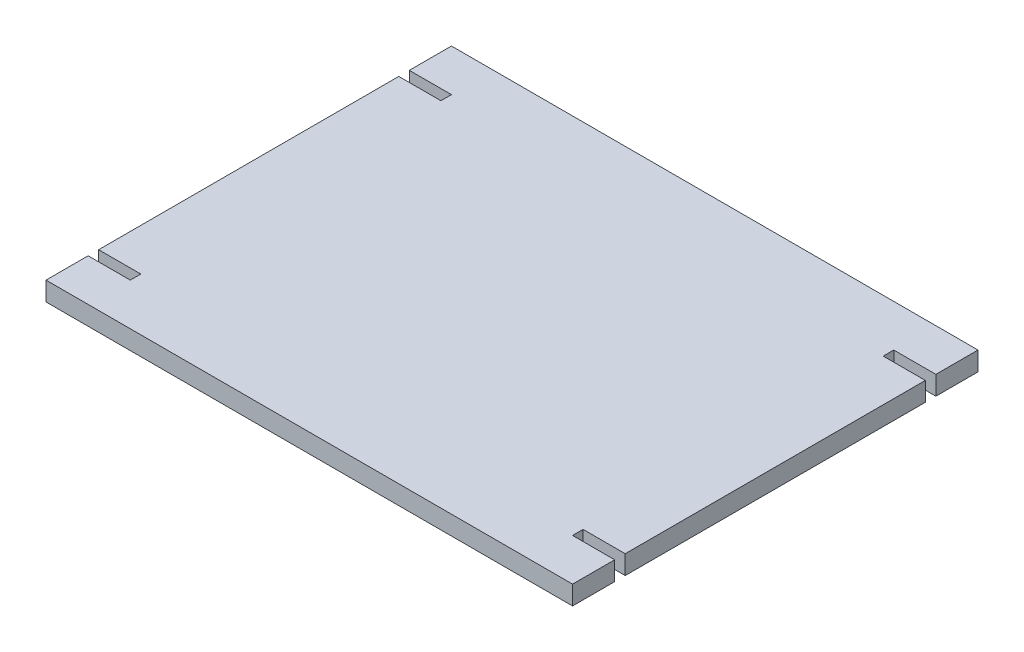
ISO-10303-21;
HEADER;
FILE_DESCRIPTION(('STEP AP214'),'2;1');
FILE_NAME('part.step','',(''),(''),'','','');
FILE_SCHEMA(('AUTOMOTIVE_DESIGN { 1 0 10303 214 1 1 1 1 }'));
ENDSEC;
DATA;
#1=APPLICATION_CONTEXT('core data for automotive mechanical design processes');
#2=APPLICATION_PROTOCOL_DEFINITION('international standard','automotive_design',2000,#1);
#3=PRODUCT_CONTEXT('',#1,'mechanical');
#4=PRODUCT('Part','Part','',(#3));
#5=PRODUCT_RELATED_PRODUCT_CATEGORY('part','',(#4));
#6=PRODUCT_DEFINITION_FORMATION('','',#4);
#7=PRODUCT_DEFINITION_CONTEXT('part definition',#1,'design');
#8=PRODUCT_DEFINITION('design','',#6,#7);
#9=PRODUCT_DEFINITION_SHAPE('','',#8);
#10=(LENGTH_UNIT() NAMED_UNIT(*) SI_UNIT(.MILLI.,.METRE.));
#11=(NAMED_UNIT(*) PLANE_ANGLE_UNIT() SI_UNIT($,.RADIAN.));
#12=(NAMED_UNIT(*) SI_UNIT($,.STERADIAN.) SOLID_ANGLE_UNIT());
#13=UNCERTAINTY_MEASURE_WITH_UNIT(LENGTH_MEASURE(1.E-05),#10,'distance_accuracy_value','');
#14=(GEOMETRIC_REPRESENTATION_CONTEXT(3) GLOBAL_UNCERTAINTY_ASSIGNED_CONTEXT((#13)) GLOBAL_UNIT_ASSIGNED_CONTEXT((#10,
#11,#12)) REPRESENTATION_CONTEXT('',''));
#15=CARTESIAN_POINT('',(0.,0.,0.));
#16=DIRECTION('',(0.,0.,1.));
#17=DIRECTION('',(1.,0.,0.));
#18=AXIS2_PLACEMENT_3D('',#15,#16,#17);
#19=CARTESIAN_POINT('',(-301.875,18.,-164.0625));
#20=DIRECTION('',(1.,0.,0.));
#21=DIRECTION('',(0.,0.,-1.));
#22=AXIS2_PLACEMENT_3D('',#19,#20,#21);
#23=PLANE('',#22);
#24=DIRECTION('',(0.,0.,1.));
#25=VECTOR('',#24,1.);
#26=CARTESIAN_POINT('',(-301.875,0.,-164.0625));
#27=LINE('',#26,#25);
#28=CARTESIAN_POINT('',(-301.875,0.,-204.0625));
#29=VERTEX_POINT('',#28);
#30=CARTESIAN_POINT('',(-301.875,0.,-164.0625));
#31=VERTEX_POINT('',#30);
#32=EDGE_CURVE('E201',#29,#31,#27,.T.);
#33=ORIENTED_EDGE('',*,*,#32,.T.);
#34=DIRECTION('',(0.,-1.,0.));
#35=VECTOR('',#34,1.);
#36=CARTESIAN_POINT('',(-301.875,18.,-164.0625));
#37=LINE('',#36,#35);
#38=CARTESIAN_POINT('',(-301.875,18.,-164.0625));
#39=VERTEX_POINT('',#38);
#40=EDGE_CURVE('E11',#39,#31,#37,.T.);
#41=ORIENTED_EDGE('',*,*,#40,.F.);
#42=DIRECTION('',(0.,0.,1.));
#43=VECTOR('',#42,1.);
#44=CARTESIAN_POINT('',(-301.875,18.,-164.0625));
#45=LINE('',#44,#43);
#46=CARTESIAN_POINT('',(-301.875,18.,-204.0625));
#47=VERTEX_POINT('',#46);
#48=EDGE_CURVE('E239',#47,#39,#45,.T.);
#49=ORIENTED_EDGE('',*,*,#48,.F.);
#50=DIRECTION('',(0.,-1.,0.));
#51=VECTOR('',#50,1.);
#52=CARTESIAN_POINT('',(-301.875,18.,-204.0625));
#53=LINE('',#52,#51);
#54=EDGE_CURVE('E197',#47,#29,#53,.T.);
#55=ORIENTED_EDGE('',*,*,#54,.T.);
#56=EDGE_LOOP('',(#33,#41,#49,#55));
#57=FACE_BOUND('',#56,.T.);
#58=ADVANCED_FACE('F33',(#57),#23,.F.);
#59=CARTESIAN_POINT('',(-261.875,18.,-164.0625));
#60=DIRECTION('',(0.,0.,-1.));
#61=DIRECTION('',(-1.,0.,0.));
#62=AXIS2_PLACEMENT_3D('',#59,#60,#61);
#63=PLANE('',#62);
#64=DIRECTION('',(1.,0.,0.));
#65=VECTOR('',#64,1.);
#66=CARTESIAN_POINT('',(-261.875,0.,-164.0625));
#67=LINE('',#66,#65);
#68=CARTESIAN_POINT('',(-261.875,0.,-164.0625));
#69=VERTEX_POINT('',#68);
#70=EDGE_CURVE('E204',#31,#69,#67,.T.);
#71=ORIENTED_EDGE('',*,*,#70,.T.);
#72=DIRECTION('',(0.,-1.,0.));
#73=VECTOR('',#72,1.);
#74=CARTESIAN_POINT('',(-261.875,18.,-164.0625));
#75=LINE('',#74,#73);
#76=CARTESIAN_POINT('',(-261.875,18.,-164.0625));
#77=VERTEX_POINT('',#76);
#78=EDGE_CURVE('E41',#77,#69,#75,.T.);
#79=ORIENTED_EDGE('',*,*,#78,.F.);
#80=DIRECTION('',(1.,0.,0.));
#81=VECTOR('',#80,1.);
#82=CARTESIAN_POINT('',(-261.875,18.,-164.0625));
#83=LINE('',#82,#81);
#84=EDGE_CURVE('E128',#39,#77,#83,.T.);
#85=ORIENTED_EDGE('',*,*,#84,.F.);
#86=ORIENTED_EDGE('',*,*,#40,.T.);
#87=EDGE_LOOP('',(#71,#79,#85,#86));
#88=FACE_BOUND('',#87,.T.);
#89=ADVANCED_FACE('F357',(#88),#63,.F.);
#90=CARTESIAN_POINT('',(-261.875,18.,-154.0625));
#91=DIRECTION('',(1.,0.,0.));
#92=DIRECTION('',(0.,0.,-1.));
#93=AXIS2_PLACEMENT_3D('',#90,#91,#92);
#94=PLANE('',#93);
#95=DIRECTION('',(0.,0.,1.));
#96=VECTOR('',#95,1.);
#97=CARTESIAN_POINT('',(-261.875,0.,-154.0625));
#98=LINE('',#97,#96);
#99=CARTESIAN_POINT('',(-261.875,0.,-154.0625));
#100=VERTEX_POINT('',#99);
#101=EDGE_CURVE('E206',#69,#100,#98,.T.);
#102=ORIENTED_EDGE('',*,*,#101,.T.);
#103=DIRECTION('',(0.,-1.,0.));
#104=VECTOR('',#103,1.);
#105=CARTESIAN_POINT('',(-261.875,18.,-154.0625));
#106=LINE('',#105,#104);
#107=CARTESIAN_POINT('',(-261.875,18.,-154.0625));
#108=VERTEX_POINT('',#107);
#109=EDGE_CURVE('E282',#108,#100,#106,.T.);
#110=ORIENTED_EDGE('',*,*,#109,.F.);
#111=DIRECTION('',(0.,0.,1.));
#112=VECTOR('',#111,1.);
#113=CARTESIAN_POINT('',(-261.875,18.,-154.0625));
#114=LINE('',#113,#112);
#115=EDGE_CURVE('E290',#77,#108,#114,.T.);
#116=ORIENTED_EDGE('',*,*,#115,.F.);
#117=ORIENTED_EDGE('',*,*,#78,.T.);
#118=EDGE_LOOP('',(#102,#110,#116,#117));
#119=FACE_BOUND('',#118,.T.);
#120=ADVANCED_FACE('F288',(#119),#94,.F.);
#121=CARTESIAN_POINT('',(-301.875,18.,-154.0625));
#122=DIRECTION('',(0.,0.,1.));
#123=DIRECTION('',(1.,0.,0.));
#124=AXIS2_PLACEMENT_3D('',#121,#122,#123);
#125=PLANE('',#124);
#126=DIRECTION('',(-1.,0.,0.));
#127=VECTOR('',#126,1.);
#128=CARTESIAN_POINT('',(-301.875,0.,-154.0625));
#129=LINE('',#128,#127);
#130=CARTESIAN_POINT('',(-301.875,0.,-154.0625));
#131=VERTEX_POINT('',#130);
#132=EDGE_CURVE('E208',#100,#131,#129,.T.);
#133=ORIENTED_EDGE('',*,*,#132,.T.);
#134=DIRECTION('',(0.,-1.,0.));
#135=VECTOR('',#134,1.);
#136=CARTESIAN_POINT('',(-301.875,18.,-154.0625));
#137=LINE('',#136,#135);
#138=CARTESIAN_POINT('',(-301.875,18.,-154.0625));
#139=VERTEX_POINT('',#138);
#140=EDGE_CURVE('E279',#139,#131,#137,.T.);
#141=ORIENTED_EDGE('',*,*,#140,.F.);
#142=DIRECTION('',(-1.,0.,0.));
#143=VECTOR('',#142,1.);
#144=CARTESIAN_POINT('',(-301.875,18.,-154.0625));
#145=LINE('',#144,#143);
#146=EDGE_CURVE('E308',#108,#139,#145,.T.);
#147=ORIENTED_EDGE('',*,*,#146,.F.);
#148=ORIENTED_EDGE('',*,*,#109,.T.);
#149=EDGE_LOOP('',(#133,#141,#147,#148));
#150=FACE_BOUND('',#149,.T.);
#151=ADVANCED_FACE('F299',(#150),#125,.F.);
#152=CARTESIAN_POINT('',(-301.875,18.,130.9375));
#153=DIRECTION('',(1.,0.,0.));
#154=DIRECTION('',(0.,0.,-1.));
#155=AXIS2_PLACEMENT_3D('',#152,#153,#154);
#156=PLANE('',#155);
#157=DIRECTION('',(0.,0.,1.));
#158=VECTOR('',#157,1.);
#159=CARTESIAN_POINT('',(-301.875,0.,130.9375));
#160=LINE('',#159,#158);
#161=CARTESIAN_POINT('',(-301.875,0.,130.9375));
#162=VERTEX_POINT('',#161);
#163=EDGE_CURVE('E210',#131,#162,#160,.T.);
#164=ORIENTED_EDGE('',*,*,#163,.T.);
#165=DIRECTION('',(0.,-1.,0.));
#166=VECTOR('',#165,1.);
#167=CARTESIAN_POINT('',(-301.875,18.,130.9375));
#168=LINE('',#167,#166);
#169=CARTESIAN_POINT('',(-301.875,18.,130.9375));
#170=VERTEX_POINT('',#169);
#171=EDGE_CURVE('E276',#170,#162,#168,.T.);
#172=ORIENTED_EDGE('',*,*,#171,.F.);
#173=DIRECTION('',(0.,0.,1.));
#174=VECTOR('',#173,1.);
#175=CARTESIAN_POINT('',(-301.875,18.,130.9375));
#176=LINE('',#175,#174);
#177=EDGE_CURVE('E305',#139,#170,#176,.T.);
#178=ORIENTED_EDGE('',*,*,#177,.F.);
#179=ORIENTED_EDGE('',*,*,#140,.T.);
#180=EDGE_LOOP('',(#164,#172,#178,#179));
#181=FACE_BOUND('',#180,.T.);
#182=ADVANCED_FACE('F303',(#181),#156,.F.);
#183=CARTESIAN_POINT('',(-261.875,18.,130.9375));
#184=DIRECTION('',(0.,0.,-1.));
#185=DIRECTION('',(-1.,0.,0.));
#186=AXIS2_PLACEMENT_3D('',#183,#184,#185);
#187=PLANE('',#186);
#188=DIRECTION('',(1.,0.,0.));
#189=VECTOR('',#188,1.);
#190=CARTESIAN_POINT('',(-261.875,0.,130.9375));
#191=LINE('',#190,#189);
#192=CARTESIAN_POINT('',(-261.875,0.,130.9375));
#193=VERTEX_POINT('',#192);
#194=EDGE_CURVE('E212',#162,#193,#191,.T.);
#195=ORIENTED_EDGE('',*,*,#194,.T.);
#196=DIRECTION('',(0.,-1.,0.));
#197=VECTOR('',#196,1.);
#198=CARTESIAN_POINT('',(-261.875,18.,130.9375));
#199=LINE('',#198,#197);
#200=CARTESIAN_POINT('',(-261.875,18.,130.9375));
#201=VERTEX_POINT('',#200);
#202=EDGE_CURVE('E273',#201,#193,#199,.T.);
#203=ORIENTED_EDGE('',*,*,#202,.F.);
#204=DIRECTION('',(1.,0.,0.));
#205=VECTOR('',#204,1.);
#206=CARTESIAN_POINT('',(-261.875,18.,130.9375));
#207=LINE('',#206,#205);
#208=EDGE_CURVE('E307',#170,#201,#207,.T.);
#209=ORIENTED_EDGE('',*,*,#208,.F.);
#210=ORIENTED_EDGE('',*,*,#171,.T.);
#211=EDGE_LOOP('',(#195,#203,#209,#210));
#212=FACE_BOUND('',#211,.T.);
#213=ADVANCED_FACE('F370',(#212),#187,.F.);
#214=CARTESIAN_POINT('',(-261.875,18.,140.9375));
#215=DIRECTION('',(1.,0.,0.));
#216=DIRECTION('',(0.,0.,-1.));
#217=AXIS2_PLACEMENT_3D('',#214,#215,#216);
#218=PLANE('',#217);
#219=DIRECTION('',(0.,0.,1.));
#220=VECTOR('',#219,1.);
#221=CARTESIAN_POINT('',(-261.875,0.,140.9375));
#222=LINE('',#221,#220);
#223=CARTESIAN_POINT('',(-261.875,0.,140.9375));
#224=VERTEX_POINT('',#223);
#225=EDGE_CURVE('E214',#193,#224,#222,.T.);
#226=ORIENTED_EDGE('',*,*,#225,.T.);
#227=DIRECTION('',(0.,-1.,0.));
#228=VECTOR('',#227,1.);
#229=CARTESIAN_POINT('',(-261.875,18.,140.9375));
#230=LINE('',#229,#228);
#231=CARTESIAN_POINT('',(-261.875,18.,140.9375));
#232=VERTEX_POINT('',#231);
#233=EDGE_CURVE('E270',#232,#224,#230,.T.);
#234=ORIENTED_EDGE('',*,*,#233,.F.);
#235=DIRECTION('',(0.,0.,1.));
#236=VECTOR('',#235,1.);
#237=CARTESIAN_POINT('',(-261.875,18.,140.9375));
#238=LINE('',#237,#236);
#239=EDGE_CURVE('E310',#201,#232,#238,.T.);
#240=ORIENTED_EDGE('',*,*,#239,.F.);
#241=ORIENTED_EDGE('',*,*,#202,.T.);
#242=EDGE_LOOP('',(#226,#234,#240,#241));
#243=FACE_BOUND('',#242,.T.);
#244=ADVANCED_FACE('F373',(#243),#218,.F.);
#245=CARTESIAN_POINT('',(-301.875,18.,140.9375));
#246=DIRECTION('',(0.,0.,1.));
#247=DIRECTION('',(1.,0.,0.));
#248=AXIS2_PLACEMENT_3D('',#245,#246,#247);
#249=PLANE('',#248);
#250=DIRECTION('',(-1.,0.,0.));
#251=VECTOR('',#250,1.);
#252=CARTESIAN_POINT('',(-301.875,0.,140.9375));
#253=LINE('',#252,#251);
#254=CARTESIAN_POINT('',(-301.875,0.,140.9375));
#255=VERTEX_POINT('',#254);
#256=EDGE_CURVE('E216',#224,#255,#253,.T.);
#257=ORIENTED_EDGE('',*,*,#256,.T.);
#258=DIRECTION('',(0.,-1.,0.));
#259=VECTOR('',#258,1.);
#260=CARTESIAN_POINT('',(-301.875,18.,140.9375));
#261=LINE('',#260,#259);
#262=CARTESIAN_POINT('',(-301.875,18.,140.9375));
#263=VERTEX_POINT('',#262);
#264=EDGE_CURVE('E267',#263,#255,#261,.T.);
#265=ORIENTED_EDGE('',*,*,#264,.F.);
#266=DIRECTION('',(-1.,0.,0.));
#267=VECTOR('',#266,1.);
#268=CARTESIAN_POINT('',(-301.875,18.,140.9375));
#269=LINE('',#268,#267);
#270=EDGE_CURVE('E316',#232,#263,#269,.T.);
#271=ORIENTED_EDGE('',*,*,#270,.F.);
#272=ORIENTED_EDGE('',*,*,#233,.T.);
#273=EDGE_LOOP('',(#257,#265,#271,#272));
#274=FACE_BOUND('',#273,.T.);
#275=ADVANCED_FACE('F377',(#274),#249,.F.);
#276=CARTESIAN_POINT('',(-301.875,18.,180.9375));
#277=DIRECTION('',(1.,0.,0.));
#278=DIRECTION('',(0.,0.,-1.));
#279=AXIS2_PLACEMENT_3D('',#276,#277,#278);
#280=PLANE('',#279);
#281=DIRECTION('',(0.,0.,1.));
#282=VECTOR('',#281,1.);
#283=CARTESIAN_POINT('',(-301.875,0.,180.9375));
#284=LINE('',#283,#282);
#285=CARTESIAN_POINT('',(-301.875,0.,180.9375));
#286=VERTEX_POINT('',#285);
#287=EDGE_CURVE('E218',#255,#286,#284,.T.);
#288=ORIENTED_EDGE('',*,*,#287,.T.);
#289=DIRECTION('',(0.,-1.,0.));
#290=VECTOR('',#289,1.);
#291=CARTESIAN_POINT('',(-301.875,18.,180.9375));
#292=LINE('',#291,#290);
#293=CARTESIAN_POINT('',(-301.875,18.,180.9375));
#294=VERTEX_POINT('',#293);
#295=EDGE_CURVE('E264',#294,#286,#292,.T.);
#296=ORIENTED_EDGE('',*,*,#295,.F.);
#297=DIRECTION('',(0.,0.,1.));
#298=VECTOR('',#297,1.);
#299=CARTESIAN_POINT('',(-301.875,18.,180.9375));
#300=LINE('',#299,#298);
#301=EDGE_CURVE('E318',#263,#294,#300,.T.);
#302=ORIENTED_EDGE('',*,*,#301,.F.);
#303=ORIENTED_EDGE('',*,*,#264,.T.);
#304=EDGE_LOOP('',(#288,#296,#302,#303));
#305=FACE_BOUND('',#304,.T.);
#306=ADVANCED_FACE('F381',(#305),#280,.F.);
#307=CARTESIAN_POINT('',(198.125,18.,180.9375));
#308=DIRECTION('',(0.,0.,-1.));
#309=DIRECTION('',(-1.,0.,0.));
#310=AXIS2_PLACEMENT_3D('',#307,#308,#309);
#311=PLANE('',#310);
#312=DIRECTION('',(1.,0.,0.));
#313=VECTOR('',#312,1.);
#314=CARTESIAN_POINT('',(198.125,0.,180.9375));
#315=LINE('',#314,#313);
#316=CARTESIAN_POINT('',(198.125,0.,180.9375));
#317=VERTEX_POINT('',#316);
#318=EDGE_CURVE('E220',#286,#317,#315,.T.);
#319=ORIENTED_EDGE('',*,*,#318,.T.);
#320=DIRECTION('',(0.,-1.,0.));
#321=VECTOR('',#320,1.);
#322=CARTESIAN_POINT('',(198.125,18.,180.9375));
#323=LINE('',#322,#321);
#324=CARTESIAN_POINT('',(198.125,18.,180.9375));
#325=VERTEX_POINT('',#324);
#326=EDGE_CURVE('E261',#325,#317,#323,.T.);
#327=ORIENTED_EDGE('',*,*,#326,.F.);
#328=DIRECTION('',(1.,0.,0.));
#329=VECTOR('',#328,1.);
#330=CARTESIAN_POINT('',(198.125,18.,180.9375));
#331=LINE('',#330,#329);
#332=EDGE_CURVE('E320',#294,#325,#331,.T.);
#333=ORIENTED_EDGE('',*,*,#332,.F.);
#334=ORIENTED_EDGE('',*,*,#295,.T.);
#335=EDGE_LOOP('',(#319,#327,#333,#334));
#336=FACE_BOUND('',#335,.T.);
#337=ADVANCED_FACE('F385',(#336),#311,.F.);
#338=CARTESIAN_POINT('',(198.125,18.,140.9375));
#339=DIRECTION('',(-1.,0.,0.));
#340=DIRECTION('',(0.,0.,1.));
#341=AXIS2_PLACEMENT_3D('',#338,#339,#340);
#342=PLANE('',#341);
#343=DIRECTION('',(0.,0.,-1.));
#344=VECTOR('',#343,1.);
#345=CARTESIAN_POINT('',(198.125,0.,140.9375));
#346=LINE('',#345,#344);
#347=CARTESIAN_POINT('',(198.125,0.,140.9375));
#348=VERTEX_POINT('',#347);
#349=EDGE_CURVE('E222',#317,#348,#346,.T.);
#350=ORIENTED_EDGE('',*,*,#349,.T.);
#351=DIRECTION('',(0.,-1.,0.));
#352=VECTOR('',#351,1.);
#353=CARTESIAN_POINT('',(198.125,18.,140.9375));
#354=LINE('',#353,#352);
#355=CARTESIAN_POINT('',(198.125,18.,140.9375));
#356=VERTEX_POINT('',#355);
#357=EDGE_CURVE('E258',#356,#348,#354,.T.);
#358=ORIENTED_EDGE('',*,*,#357,.F.);
#359=DIRECTION('',(0.,0.,-1.));
#360=VECTOR('',#359,1.);
#361=CARTESIAN_POINT('',(198.125,18.,140.9375));
#362=LINE('',#361,#360);
#363=EDGE_CURVE('E322',#325,#356,#362,.T.);
#364=ORIENTED_EDGE('',*,*,#363,.F.);
#365=ORIENTED_EDGE('',*,*,#326,.T.);
#366=EDGE_LOOP('',(#350,#358,#364,#365));
#367=FACE_BOUND('',#366,.T.);
#368=ADVANCED_FACE('F389',(#367),#342,.F.);
#369=CARTESIAN_POINT('',(158.125,18.,140.9375));
#370=DIRECTION('',(0.,0.,1.));
#371=DIRECTION('',(1.,0.,0.));
#372=AXIS2_PLACEMENT_3D('',#369,#370,#371);
#373=PLANE('',#372);
#374=DIRECTION('',(-1.,0.,0.));
#375=VECTOR('',#374,1.);
#376=CARTESIAN_POINT('',(158.125,0.,140.9375));
#377=LINE('',#376,#375);
#378=CARTESIAN_POINT('',(158.125,0.,140.9375));
#379=VERTEX_POINT('',#378);
#380=EDGE_CURVE('E224',#348,#379,#377,.T.);
#381=ORIENTED_EDGE('',*,*,#380,.T.);
#382=DIRECTION('',(0.,-1.,0.));
#383=VECTOR('',#382,1.);
#384=CARTESIAN_POINT('',(158.125,18.,140.9375));
#385=LINE('',#384,#383);
#386=CARTESIAN_POINT('',(158.125,18.,140.9375));
#387=VERTEX_POINT('',#386);
#388=EDGE_CURVE('E255',#387,#379,#385,.T.);
#389=ORIENTED_EDGE('',*,*,#388,.F.);
#390=DIRECTION('',(-1.,0.,0.));
#391=VECTOR('',#390,1.);
#392=CARTESIAN_POINT('',(158.125,18.,140.9375));
#393=LINE('',#392,#391);
#394=EDGE_CURVE('E324',#356,#387,#393,.T.);
#395=ORIENTED_EDGE('',*,*,#394,.F.);
#396=ORIENTED_EDGE('',*,*,#357,.T.);
#397=EDGE_LOOP('',(#381,#389,#395,#396));
#398=FACE_BOUND('',#397,.T.);
#399=ADVANCED_FACE('F393',(#398),#373,.F.);
#400=CARTESIAN_POINT('',(158.125,18.,130.9375));
#401=DIRECTION('',(-1.,0.,0.));
#402=DIRECTION('',(0.,0.,1.));
#403=AXIS2_PLACEMENT_3D('',#400,#401,#402);
#404=PLANE('',#403);
#405=DIRECTION('',(0.,0.,-1.));
#406=VECTOR('',#405,1.);
#407=CARTESIAN_POINT('',(158.125,0.,130.9375));
#408=LINE('',#407,#406);
#409=CARTESIAN_POINT('',(158.125,0.,130.9375));
#410=VERTEX_POINT('',#409);
#411=EDGE_CURVE('E226',#379,#410,#408,.T.);
#412=ORIENTED_EDGE('',*,*,#411,.T.);
#413=DIRECTION('',(0.,-1.,0.));
#414=VECTOR('',#413,1.);
#415=CARTESIAN_POINT('',(158.125,18.,130.9375));
#416=LINE('',#415,#414);
#417=CARTESIAN_POINT('',(158.125,18.,130.9375));
#418=VERTEX_POINT('',#417);
#419=EDGE_CURVE('E252',#418,#410,#416,.T.);
#420=ORIENTED_EDGE('',*,*,#419,.F.);
#421=DIRECTION('',(0.,0.,-1.));
#422=VECTOR('',#421,1.);
#423=CARTESIAN_POINT('',(158.125,18.,130.9375));
#424=LINE('',#423,#422);
#425=EDGE_CURVE('E326',#387,#418,#424,.T.);
#426=ORIENTED_EDGE('',*,*,#425,.F.);
#427=ORIENTED_EDGE('',*,*,#388,.T.);
#428=EDGE_LOOP('',(#412,#420,#426,#427));
#429=FACE_BOUND('',#428,.T.);
#430=ADVANCED_FACE('F397',(#429),#404,.F.);
#431=CARTESIAN_POINT('',(198.125,18.,130.9375));
#432=DIRECTION('',(0.,0.,-1.));
#433=DIRECTION('',(-1.,0.,0.));
#434=AXIS2_PLACEMENT_3D('',#431,#432,#433);
#435=PLANE('',#434);
#436=DIRECTION('',(1.,0.,0.));
#437=VECTOR('',#436,1.);
#438=CARTESIAN_POINT('',(198.125,0.,130.9375));
#439=LINE('',#438,#437);
#440=CARTESIAN_POINT('',(198.125,0.,130.9375));
#441=VERTEX_POINT('',#440);
#442=EDGE_CURVE('E228',#410,#441,#439,.T.);
#443=ORIENTED_EDGE('',*,*,#442,.T.);
#444=DIRECTION('',(0.,-1.,0.));
#445=VECTOR('',#444,1.);
#446=CARTESIAN_POINT('',(198.125,18.,130.9375));
#447=LINE('',#446,#445);
#448=CARTESIAN_POINT('',(198.125,18.,130.9375));
#449=VERTEX_POINT('',#448);
#450=EDGE_CURVE('E249',#449,#441,#447,.T.);
#451=ORIENTED_EDGE('',*,*,#450,.F.);
#452=DIRECTION('',(1.,0.,0.));
#453=VECTOR('',#452,1.);
#454=CARTESIAN_POINT('',(198.125,18.,130.9375));
#455=LINE('',#454,#453);
#456=EDGE_CURVE('E328',#418,#449,#455,.T.);
#457=ORIENTED_EDGE('',*,*,#456,.F.);
#458=ORIENTED_EDGE('',*,*,#419,.T.);
#459=EDGE_LOOP('',(#443,#451,#457,#458));
#460=FACE_BOUND('',#459,.T.);
#461=ADVANCED_FACE('F401',(#460),#435,.F.);
#462=CARTESIAN_POINT('',(198.125,18.,-154.0625));
#463=DIRECTION('',(-1.,0.,0.));
#464=DIRECTION('',(0.,0.,1.));
#465=AXIS2_PLACEMENT_3D('',#462,#463,#464);
#466=PLANE('',#465);
#467=DIRECTION('',(0.,0.,-1.));
#468=VECTOR('',#467,1.);
#469=CARTESIAN_POINT('',(198.125,0.,-154.0625));
#470=LINE('',#469,#468);
#471=CARTESIAN_POINT('',(198.125,0.,-154.0625));
#472=VERTEX_POINT('',#471);
#473=EDGE_CURVE('E230',#441,#472,#470,.T.);
#474=ORIENTED_EDGE('',*,*,#473,.T.);
#475=DIRECTION('',(0.,-1.,0.));
#476=VECTOR('',#475,1.);
#477=CARTESIAN_POINT('',(198.125,18.,-154.0625));
#478=LINE('',#477,#476);
#479=CARTESIAN_POINT('',(198.125,18.,-154.0625));
#480=VERTEX_POINT('',#479);
#481=EDGE_CURVE('E246',#480,#472,#478,.T.);
#482=ORIENTED_EDGE('',*,*,#481,.F.);
#483=DIRECTION('',(0.,0.,-1.));
#484=VECTOR('',#483,1.);
#485=CARTESIAN_POINT('',(198.125,18.,-154.0625));
#486=LINE('',#485,#484);
#487=EDGE_CURVE('E330',#449,#480,#486,.T.);
#488=ORIENTED_EDGE('',*,*,#487,.F.);
#489=ORIENTED_EDGE('',*,*,#450,.T.);
#490=EDGE_LOOP('',(#474,#482,#488,#489));
#491=FACE_BOUND('',#490,.T.);
#492=ADVANCED_FACE('F405',(#491),#466,.F.);
#493=CARTESIAN_POINT('',(158.125,18.,-154.0625));
#494=DIRECTION('',(0.,0.,1.));
#495=DIRECTION('',(1.,0.,0.));
#496=AXIS2_PLACEMENT_3D('',#493,#494,#495);
#497=PLANE('',#496);
#498=DIRECTION('',(-1.,0.,0.));
#499=VECTOR('',#498,1.);
#500=CARTESIAN_POINT('',(158.125,0.,-154.0625));
#501=LINE('',#500,#499);
#502=CARTESIAN_POINT('',(158.125,0.,-154.0625));
#503=VERTEX_POINT('',#502);
#504=EDGE_CURVE('E232',#472,#503,#501,.T.);
#505=ORIENTED_EDGE('',*,*,#504,.T.);
#506=DIRECTION('',(0.,-1.,0.));
#507=VECTOR('',#506,1.);
#508=CARTESIAN_POINT('',(158.125,18.,-154.0625));
#509=LINE('',#508,#507);
#510=CARTESIAN_POINT('',(158.125,18.,-154.0625));
#511=VERTEX_POINT('',#510);
#512=EDGE_CURVE('E243',#511,#503,#509,.T.);
#513=ORIENTED_EDGE('',*,*,#512,.F.);
#514=DIRECTION('',(-1.,0.,0.));
#515=VECTOR('',#514,1.);
#516=CARTESIAN_POINT('',(158.125,18.,-154.0625));
#517=LINE('',#516,#515);
#518=EDGE_CURVE('E332',#480,#511,#517,.T.);
#519=ORIENTED_EDGE('',*,*,#518,.F.);
#520=ORIENTED_EDGE('',*,*,#481,.T.);
#521=EDGE_LOOP('',(#505,#513,#519,#520));
#522=FACE_BOUND('',#521,.T.);
#523=ADVANCED_FACE('F338',(#522),#497,.F.);
#524=CARTESIAN_POINT('',(158.125,18.,-164.0625));
#525=DIRECTION('',(-1.,0.,0.));
#526=DIRECTION('',(0.,0.,1.));
#527=AXIS2_PLACEMENT_3D('',#524,#525,#526);
#528=PLANE('',#527);
#529=DIRECTION('',(0.,0.,-1.));
#530=VECTOR('',#529,1.);
#531=CARTESIAN_POINT('',(158.125,0.,-164.0625));
#532=LINE('',#531,#530);
#533=CARTESIAN_POINT('',(158.125,0.,-164.0625));
#534=VERTEX_POINT('',#533);
#535=EDGE_CURVE('E234',#503,#534,#532,.T.);
#536=ORIENTED_EDGE('',*,*,#535,.T.);
#537=DIRECTION('',(0.,-1.,0.));
#538=VECTOR('',#537,1.);
#539=CARTESIAN_POINT('',(158.125,18.,-164.0625));
#540=LINE('',#539,#538);
#541=CARTESIAN_POINT('',(158.125,18.,-164.0625));
#542=VERTEX_POINT('',#541);
#543=EDGE_CURVE('E192',#542,#534,#540,.T.);
#544=ORIENTED_EDGE('',*,*,#543,.F.);
#545=DIRECTION('',(0.,0.,-1.));
#546=VECTOR('',#545,1.);
#547=CARTESIAN_POINT('',(158.125,18.,-164.0625));
#548=LINE('',#547,#546);
#549=EDGE_CURVE('E183',#511,#542,#548,.T.);
#550=ORIENTED_EDGE('',*,*,#549,.F.);
#551=ORIENTED_EDGE('',*,*,#512,.T.);
#552=EDGE_LOOP('',(#536,#544,#550,#551));
#553=FACE_BOUND('',#552,.T.);
#554=ADVANCED_FACE('F342',(#553),#528,.F.);
#555=CARTESIAN_POINT('',(198.125,18.,-164.0625));
#556=DIRECTION('',(0.,0.,-1.));
#557=DIRECTION('',(-1.,0.,0.));
#558=AXIS2_PLACEMENT_3D('',#555,#556,#557);
#559=PLANE('',#558);
#560=DIRECTION('',(1.,0.,0.));
#561=VECTOR('',#560,1.);
#562=CARTESIAN_POINT('',(198.125,0.,-164.0625));
#563=LINE('',#562,#561);
#564=CARTESIAN_POINT('',(198.125,0.,-164.0625));
#565=VERTEX_POINT('',#564);
#566=EDGE_CURVE('E191',#534,#565,#563,.T.);
#567=ORIENTED_EDGE('',*,*,#566,.T.);
#568=DIRECTION('',(0.,-1.,0.));
#569=VECTOR('',#568,1.);
#570=CARTESIAN_POINT('',(198.125,18.,-164.0625));
#571=LINE('',#570,#569);
#572=CARTESIAN_POINT('',(198.125,18.,-164.0625));
#573=VERTEX_POINT('',#572);
#574=EDGE_CURVE('E188',#573,#565,#571,.T.);
#575=ORIENTED_EDGE('',*,*,#574,.F.);
#576=DIRECTION('',(1.,0.,0.));
#577=VECTOR('',#576,1.);
#578=CARTESIAN_POINT('',(198.125,18.,-164.0625));
#579=LINE('',#578,#577);
#580=EDGE_CURVE('E177',#542,#573,#579,.T.);
#581=ORIENTED_EDGE('',*,*,#580,.F.);
#582=ORIENTED_EDGE('',*,*,#543,.T.);
#583=EDGE_LOOP('',(#567,#575,#581,#582));
#584=FACE_BOUND('',#583,.T.);
#585=ADVANCED_FACE('F189',(#584),#559,.F.);
#586=CARTESIAN_POINT('',(198.125,18.,-204.0625));
#587=DIRECTION('',(-1.,0.,0.));
#588=DIRECTION('',(0.,0.,1.));
#589=AXIS2_PLACEMENT_3D('',#586,#587,#588);
#590=PLANE('',#589);
#591=DIRECTION('',(0.,0.,-1.));
#592=VECTOR('',#591,1.);
#593=CARTESIAN_POINT('',(198.125,0.,-204.0625));
#594=LINE('',#593,#592);
#595=CARTESIAN_POINT('',(198.125,0.,-204.0625));
#596=VERTEX_POINT('',#595);
#597=EDGE_CURVE('E114',#565,#596,#594,.T.);
#598=ORIENTED_EDGE('',*,*,#597,.T.);
#599=DIRECTION('',(0.,-1.,0.));
#600=VECTOR('',#599,1.);
#601=CARTESIAN_POINT('',(198.125,18.,-204.0625));
#602=LINE('',#601,#600);
#603=CARTESIAN_POINT('',(198.125,18.,-204.0625));
#604=VERTEX_POINT('',#603);
#605=EDGE_CURVE('E193',#604,#596,#602,.T.);
#606=ORIENTED_EDGE('',*,*,#605,.F.);
#607=DIRECTION('',(0.,0.,-1.));
#608=VECTOR('',#607,1.);
#609=CARTESIAN_POINT('',(198.125,18.,-204.0625));
#610=LINE('',#609,#608);
#611=EDGE_CURVE('E181',#573,#604,#610,.T.);
#612=ORIENTED_EDGE('',*,*,#611,.F.);
#613=ORIENTED_EDGE('',*,*,#574,.T.);
#614=EDGE_LOOP('',(#598,#606,#612,#613));
#615=FACE_BOUND('',#614,.T.);
#616=ADVANCED_FACE('F195',(#615),#590,.F.);
#617=CARTESIAN_POINT('',(-301.875,18.,-204.0625));
#618=DIRECTION('',(0.,0.,1.));
#619=DIRECTION('',(1.,0.,0.));
#620=AXIS2_PLACEMENT_3D('',#617,#618,#619);
#621=PLANE('',#620);
#622=DIRECTION('',(-1.,0.,0.));
#623=VECTOR('',#622,1.);
#624=CARTESIAN_POINT('',(-301.875,0.,-204.0625));
#625=LINE('',#624,#623);
#626=EDGE_CURVE('E120',#596,#29,#625,.T.);
#627=ORIENTED_EDGE('',*,*,#626,.T.);
#628=ORIENTED_EDGE('',*,*,#54,.F.);
#629=DIRECTION('',(-1.,0.,0.));
#630=VECTOR('',#629,1.);
#631=CARTESIAN_POINT('',(-301.875,18.,-204.0625));
#632=LINE('',#631,#630);
#633=EDGE_CURVE('E49',#604,#47,#632,.T.);
#634=ORIENTED_EDGE('',*,*,#633,.F.);
#635=ORIENTED_EDGE('',*,*,#605,.T.);
#636=EDGE_LOOP('',(#627,#628,#634,#635));
#637=FACE_BOUND('',#636,.T.);
#638=ADVANCED_FACE('F346',(#637),#621,.F.);
#639=CARTESIAN_POINT('',(0.,18.,0.));
#640=DIRECTION('',(0.,-1.,0.));
#641=DIRECTION('',(0.,0.,-1.));
#642=AXIS2_PLACEMENT_3D('',#639,#640,#641);
#643=PLANE('',#642);
#644=ORIENTED_EDGE('',*,*,#48,.T.);
#645=ORIENTED_EDGE('',*,*,#84,.T.);
#646=ORIENTED_EDGE('',*,*,#115,.T.);
#647=ORIENTED_EDGE('',*,*,#146,.T.);
#648=ORIENTED_EDGE('',*,*,#177,.T.);
#649=ORIENTED_EDGE('',*,*,#208,.T.);
#650=ORIENTED_EDGE('',*,*,#239,.T.);
#651=ORIENTED_EDGE('',*,*,#270,.T.);
#652=ORIENTED_EDGE('',*,*,#301,.T.);
#653=ORIENTED_EDGE('',*,*,#332,.T.);
#654=ORIENTED_EDGE('',*,*,#363,.T.);
#655=ORIENTED_EDGE('',*,*,#394,.T.);
#656=ORIENTED_EDGE('',*,*,#425,.T.);
#657=ORIENTED_EDGE('',*,*,#456,.T.);
#658=ORIENTED_EDGE('',*,*,#487,.T.);
#659=ORIENTED_EDGE('',*,*,#518,.T.);
#660=ORIENTED_EDGE('',*,*,#549,.T.);
#661=ORIENTED_EDGE('',*,*,#580,.T.);
#662=ORIENTED_EDGE('',*,*,#611,.T.);
#663=ORIENTED_EDGE('',*,*,#633,.T.);
#664=EDGE_LOOP('',(#644,#645,#646,#647,#648,#649,#650,#651,#652,#653,#654,#655,#656,#657,#658,
#659,#660,#661,#662,#663));
#665=FACE_BOUND('',#664,.T.);
#666=ADVANCED_FACE('F179',(#665),#643,.F.);
#667=CARTESIAN_POINT('',(0.,0.,0.));
#668=DIRECTION('',(0.,-1.,0.));
#669=DIRECTION('',(0.,0.,-1.));
#670=AXIS2_PLACEMENT_3D('',#667,#668,#669);
#671=PLANE('',#670);
#672=ORIENTED_EDGE('',*,*,#32,.F.);
#673=ORIENTED_EDGE('',*,*,#626,.F.);
#674=ORIENTED_EDGE('',*,*,#597,.F.);
#675=ORIENTED_EDGE('',*,*,#566,.F.);
#676=ORIENTED_EDGE('',*,*,#535,.F.);
#677=ORIENTED_EDGE('',*,*,#504,.F.);
#678=ORIENTED_EDGE('',*,*,#473,.F.);
#679=ORIENTED_EDGE('',*,*,#442,.F.);
#680=ORIENTED_EDGE('',*,*,#411,.F.);
#681=ORIENTED_EDGE('',*,*,#380,.F.);
#682=ORIENTED_EDGE('',*,*,#349,.F.);
#683=ORIENTED_EDGE('',*,*,#318,.F.);
#684=ORIENTED_EDGE('',*,*,#287,.F.);
#685=ORIENTED_EDGE('',*,*,#256,.F.);
#686=ORIENTED_EDGE('',*,*,#225,.F.);
#687=ORIENTED_EDGE('',*,*,#194,.F.);
#688=ORIENTED_EDGE('',*,*,#163,.F.);
#689=ORIENTED_EDGE('',*,*,#132,.F.);
#690=ORIENTED_EDGE('',*,*,#101,.F.);
#691=ORIENTED_EDGE('',*,*,#70,.F.);
#692=EDGE_LOOP('',(#672,#673,#674,#675,#676,#677,#678,#679,#680,#681,#682,#683,#684,#685,#686,
#687,#688,#689,#690,#691));
#693=FACE_BOUND('',#692,.T.);
#694=ADVANCED_FACE('F294',(#693),#671,.T.);
#695=CLOSED_SHELL('',(#58,#89,#120,#151,#182,#213,#244,#275,#306,#337,#368,#399,#430,#461,#492,
#523,#554,#585,#616,#638,#666,#694));
#696=MANIFOLD_SOLID_BREP('B2',#695);
#697=ADVANCED_BREP_SHAPE_REPRESENTATION('',(#18,#696),#14);
#698=SHAPE_DEFINITION_REPRESENTATION(#9,#697);
ENDSEC;
END-ISO-10303-21;
